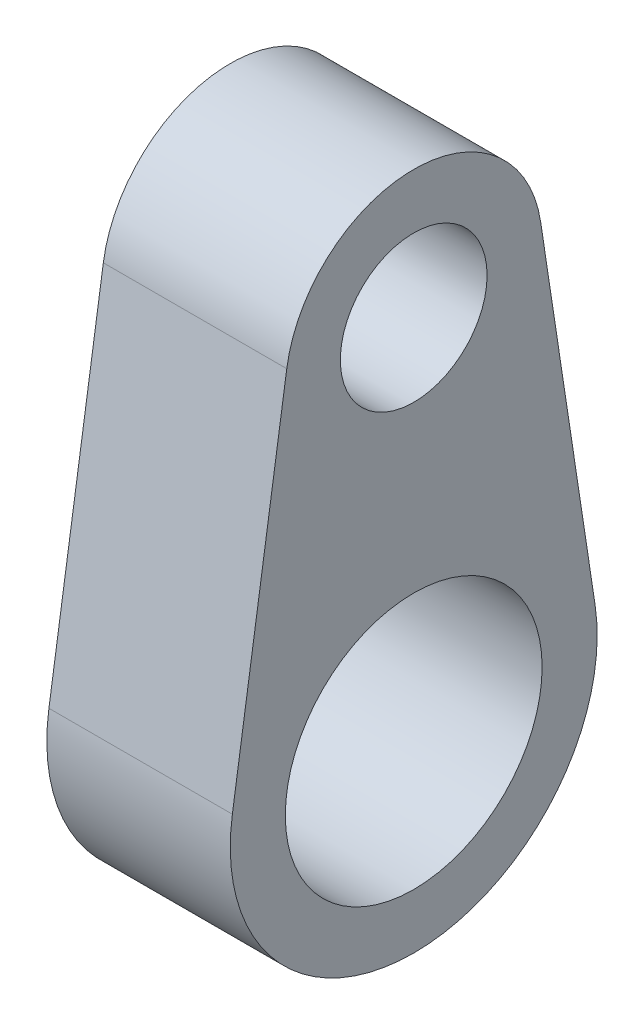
from build123d import *

# Parameters (mm, degrees)
SKETCH1_R           = 10
SKETCH1_R_2         = 17.5
BOSS_EXTRUDE1_DEPTH = 12.5


with BuildPart() as part:
    # Sketch1 → Boss-Extrude1 (new, symmetric)
    with BuildSketch(Plane(origin=(0, 0, 0), x_dir=(0, 0, -1), z_dir=(1, 0, 0))):
        with BuildLine():
            Line((-17.302004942, 2.625), (-24.717149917, -46.25))
            ThreePointArc((-24.717149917, -46.25), (0, -75), (24.717149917, -46.25))
            Line((24.717149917, -46.25), (17.302004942, 2.625))
            ThreePointArc((17.302004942, 2.625), (0, 17.5), (-17.302004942, 2.625))
        make_face()
        Circle(SKETCH1_R, mode=Mode.SUBTRACT)
        with Locations((0, -50)):
            Circle(SKETCH1_R_2, mode=Mode.SUBTRACT)
    extrude(amount=BOSS_EXTRUDE1_DEPTH, both=True)


solid = part.part
